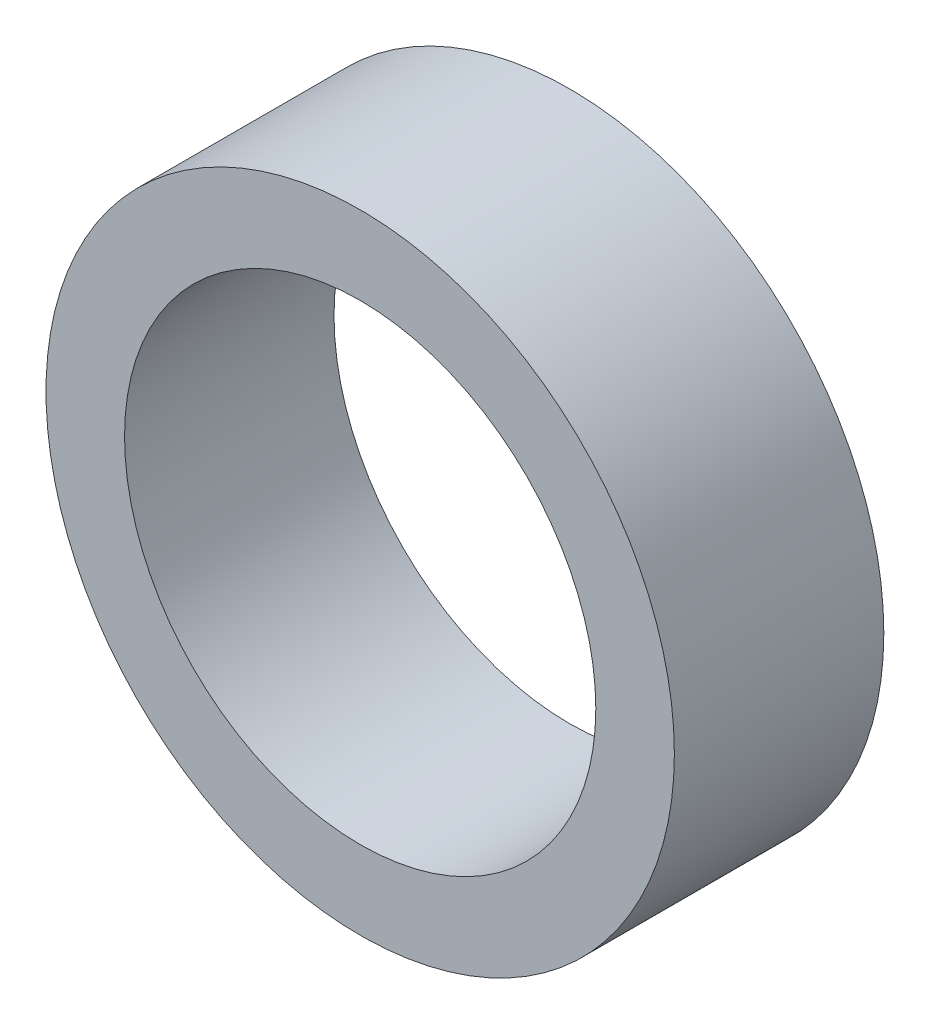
from build123d import *

# Parameters (mm, degrees)
ESQUISSE1_R      = 12
ESQUISSE1_R_2    = 9
EXTRUSION1_DEPTH = 8


with BuildPart() as part:
    # Esquisse1 → Extrusion1 (new body)
    with BuildSketch(Plane.XY):
        Circle(ESQUISSE1_R)
        Circle(ESQUISSE1_R_2, mode=Mode.SUBTRACT)
    extrude(amount=EXTRUSION1_DEPTH)


solid = part.part
